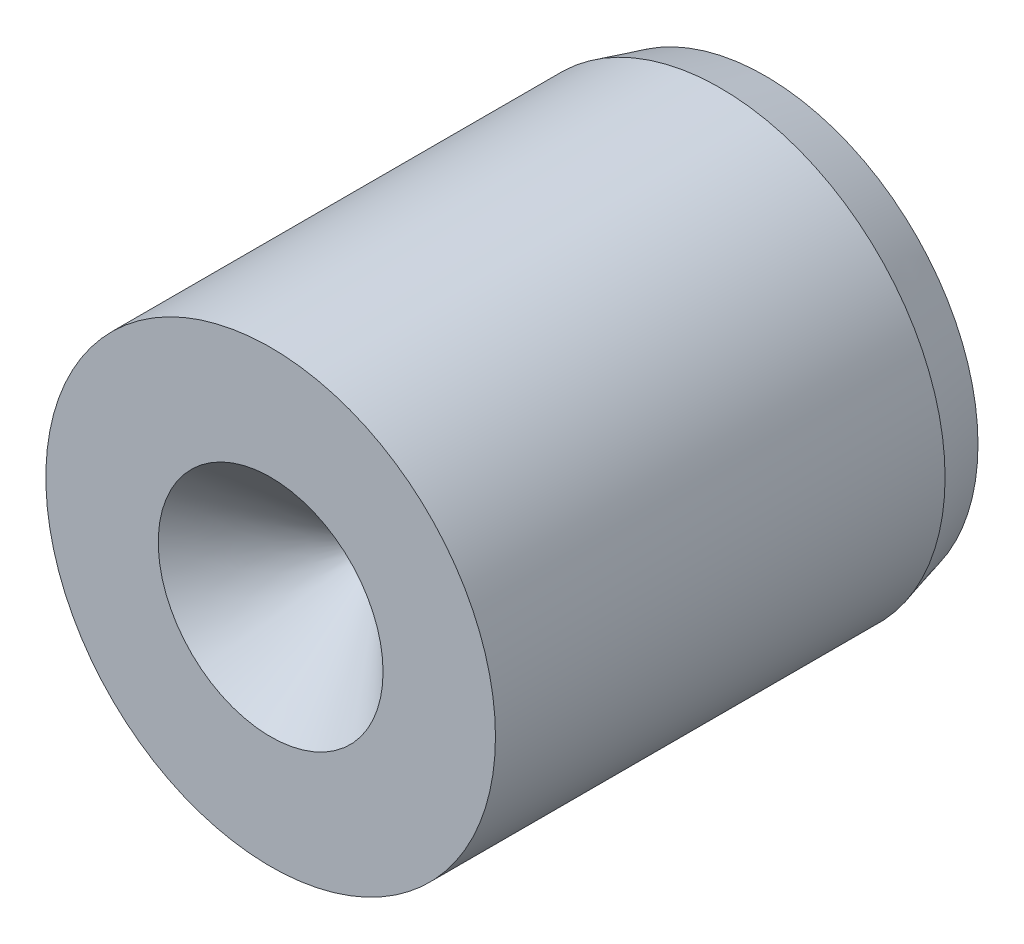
ISO-10303-21;
HEADER;
FILE_DESCRIPTION(('STEP AP214'),'2;1');
FILE_NAME('part.step','',(''),(''),'','','');
FILE_SCHEMA(('AUTOMOTIVE_DESIGN { 1 0 10303 214 1 1 1 1 }'));
ENDSEC;
DATA;
#1=APPLICATION_CONTEXT('core data for automotive mechanical design processes');
#2=APPLICATION_PROTOCOL_DEFINITION('international standard','automotive_design',2000,#1);
#3=PRODUCT_CONTEXT('',#1,'mechanical');
#4=PRODUCT('Part','Part','',(#3));
#5=PRODUCT_RELATED_PRODUCT_CATEGORY('part','',(#4));
#6=PRODUCT_DEFINITION_FORMATION('','',#4);
#7=PRODUCT_DEFINITION_CONTEXT('part definition',#1,'design');
#8=PRODUCT_DEFINITION('design','',#6,#7);
#9=PRODUCT_DEFINITION_SHAPE('','',#8);
#10=(LENGTH_UNIT() NAMED_UNIT(*) SI_UNIT(.MILLI.,.METRE.));
#11=(NAMED_UNIT(*) PLANE_ANGLE_UNIT() SI_UNIT($,.RADIAN.));
#12=(NAMED_UNIT(*) SI_UNIT($,.STERADIAN.) SOLID_ANGLE_UNIT());
#13=UNCERTAINTY_MEASURE_WITH_UNIT(LENGTH_MEASURE(1.E-05),#10,'distance_accuracy_value','');
#14=(GEOMETRIC_REPRESENTATION_CONTEXT(3) GLOBAL_UNCERTAINTY_ASSIGNED_CONTEXT((#13)) GLOBAL_UNIT_ASSIGNED_CONTEXT((#10,
#11,#12)) REPRESENTATION_CONTEXT('',''));
#15=CARTESIAN_POINT('',(0.,0.,0.));
#16=DIRECTION('',(0.,0.,1.));
#17=DIRECTION('',(1.,0.,0.));
#18=AXIS2_PLACEMENT_3D('',#15,#16,#17);
#19=CARTESIAN_POINT('',(0.,10.,22.));
#20=DIRECTION('',(0.,0.,-1.));
#21=DIRECTION('',(-1.,0.,0.));
#22=AXIS2_PLACEMENT_3D('',#19,#20,#21);
#23=PLANE('',#22);
#24=CARTESIAN_POINT('',(0.,0.,22.));
#25=DIRECTION('',(0.,0.,1.));
#26=DIRECTION('',(1.,0.,0.));
#27=AXIS2_PLACEMENT_3D('',#24,#25,#26);
#28=CIRCLE('',#27,5.);
#29=CARTESIAN_POINT('',(5.,0.,22.));
#30=VERTEX_POINT('',#29);
#31=EDGE_CURVE('E9',#30,#30,#28,.T.);
#32=ORIENTED_EDGE('',*,*,#31,.F.);
#33=EDGE_LOOP('',(#32));
#34=FACE_BOUND('',#33,.T.);
#35=CARTESIAN_POINT('',(0.,0.,22.));
#36=DIRECTION('',(0.,0.,1.));
#37=DIRECTION('',(1.,0.,0.));
#38=AXIS2_PLACEMENT_3D('',#35,#36,#37);
#39=CIRCLE('',#38,10.);
#40=CARTESIAN_POINT('',(10.,0.,22.));
#41=VERTEX_POINT('',#40);
#42=EDGE_CURVE('E33',#41,#41,#39,.T.);
#43=ORIENTED_EDGE('',*,*,#42,.T.);
#44=EDGE_LOOP('',(#43));
#45=FACE_BOUND('',#44,.T.);
#46=ADVANCED_FACE('F14',(#34,#45),#23,.F.);
#47=CARTESIAN_POINT('',(0.,0.,22.));
#48=DIRECTION('',(0.,0.,1.));
#49=DIRECTION('',(1.,0.,0.));
#50=AXIS2_PLACEMENT_3D('',#47,#48,#49);
#51=CONICAL_SURFACE('',#50,5.,0.78539816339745);
#52=CARTESIAN_POINT('',(0.,0.,17.));
#53=VERTEX_POINT('',#52);
#54=VERTEX_LOOP('',#53);
#55=FACE_BOUND('',#54,.T.);
#56=ORIENTED_EDGE('',*,*,#31,.T.);
#57=EDGE_LOOP('',(#56));
#58=FACE_BOUND('',#57,.T.);
#59=ADVANCED_FACE('F23',(#55,#58),#51,.F.);
#60=CARTESIAN_POINT('',(0.,9.46410161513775,0.));
#61=DIRECTION('',(0.,0.,-1.));
#62=DIRECTION('',(-1.,0.,0.));
#63=AXIS2_PLACEMENT_3D('',#60,#61,#62);
#64=PLANE('',#63);
#65=CARTESIAN_POINT('',(0.,0.,0.));
#66=DIRECTION('',(0.,0.,1.));
#67=DIRECTION('',(1.,0.,0.));
#68=AXIS2_PLACEMENT_3D('',#65,#66,#67);
#69=CIRCLE('',#68,9.46410161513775);
#70=CARTESIAN_POINT('',(9.46410161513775,0.,0.));
#71=VERTEX_POINT('',#70);
#72=EDGE_CURVE('E20',#71,#71,#69,.T.);
#73=ORIENTED_EDGE('',*,*,#72,.F.);
#74=EDGE_LOOP('',(#73));
#75=FACE_BOUND('',#74,.T.);
#76=ADVANCED_FACE('F26',(#75),#64,.T.);
#77=CARTESIAN_POINT('',(0.,0.,2.));
#78=DIRECTION('',(0.,0.,1.));
#79=DIRECTION('',(1.,0.,0.));
#80=AXIS2_PLACEMENT_3D('',#77,#78,#79);
#81=CONICAL_SURFACE('',#80,10.,0.26179938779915);
#82=ORIENTED_EDGE('',*,*,#72,.T.);
#83=EDGE_LOOP('',(#82));
#84=FACE_BOUND('',#83,.T.);
#85=CARTESIAN_POINT('',(0.,0.,2.));
#86=DIRECTION('',(0.,0.,1.));
#87=DIRECTION('',(1.,0.,0.));
#88=AXIS2_PLACEMENT_3D('',#85,#86,#87);
#89=CIRCLE('',#88,10.);
#90=CARTESIAN_POINT('',(10.,0.,2.));
#91=VERTEX_POINT('',#90);
#92=EDGE_CURVE('E35',#91,#91,#89,.T.);
#93=ORIENTED_EDGE('',*,*,#92,.F.);
#94=EDGE_LOOP('',(#93));
#95=FACE_BOUND('',#94,.T.);
#96=ADVANCED_FACE('F42',(#84,#95),#81,.T.);
#97=CARTESIAN_POINT('',(0.,0.,7.));
#98=DIRECTION('',(0.,0.,1.));
#99=DIRECTION('',(1.,0.,0.));
#100=AXIS2_PLACEMENT_3D('',#97,#98,#99);
#101=CYLINDRICAL_SURFACE('',#100,10.);
#102=ORIENTED_EDGE('',*,*,#92,.T.);
#103=EDGE_LOOP('',(#102));
#104=FACE_BOUND('',#103,.T.);
#105=ORIENTED_EDGE('',*,*,#42,.F.);
#106=EDGE_LOOP('',(#105));
#107=FACE_BOUND('',#106,.T.);
#108=ADVANCED_FACE('F51',(#104,#107),#101,.T.);
#109=CLOSED_SHELL('',(#46,#59,#76,#96,#108));
#110=MANIFOLD_SOLID_BREP('B1',#109);
#111=ADVANCED_BREP_SHAPE_REPRESENTATION('',(#18,#110),#14);
#112=SHAPE_DEFINITION_REPRESENTATION(#9,#111);
ENDSEC;
END-ISO-10303-21;
